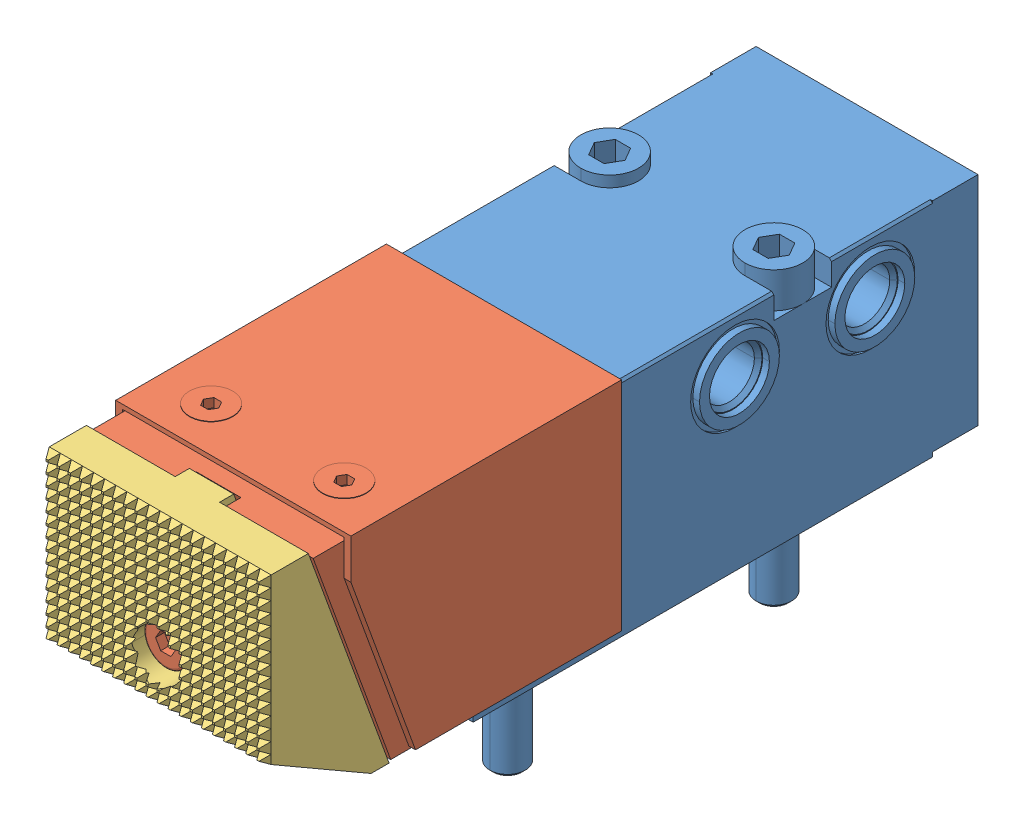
SolidWorks assembly ilcm41532020.sldasm, configuration Default (file format 5000). Lengths in mm.
Overall size (53 71 161).
3 component instances, 3 part files, 4 mates.
Components (placement in the parent):
- ilcm41532020_body-1: ilcm41532020_body.sldprt [Default] at origin size (52 71 113.75)
- ilcm41532020_piston-1: ilcm41532020_piston.sldprt [Default] at (0 2 3.5) x (0 0 -1) z (1 0 0) size (85 49.7 53)
- ilcm41532020_jaw-1: ilcm41532020_jaw.sldprt [Default] at (-25 1.5 60) x (0 0 -1) z (1 0 0) size (31.5 50 50)
Mates (geometry in assembly coordinates):
- Concentric1: concentric aligned: cylinder of ilcm41532020_body-1 through (0 25 -1.75) axis (0 0 1) radius 13; cylinder of ilcm41532020_piston-1 through (0 25 3.5) axis (0 0 1) radius 13
- Distance1: distance = 7.05 mm anti-aligned: plane of ilcm41532020_body-1 through (-25 0 44.25) normal (0 0 1); plane of ilcm41532020_piston-1 through (25 2 51.3) normal (0 0 -1)
- Coincident2: coincident anti-aligned: plane of ilcm41532020_piston-1 through (0 30 84.5) normal (0 0 -1); plane of ilcm41532020_jaw-1 through (0 29 84.5) normal (0 0 1)
- Distance2: distance = 1.5 mm aligned: plane of ilcm41532020_jaw-1 through (25 51.5 81.391) normal (0 1 0); plane of ilcm41532020_piston-1 through (25 50 51.3) normal (0 1 0)
